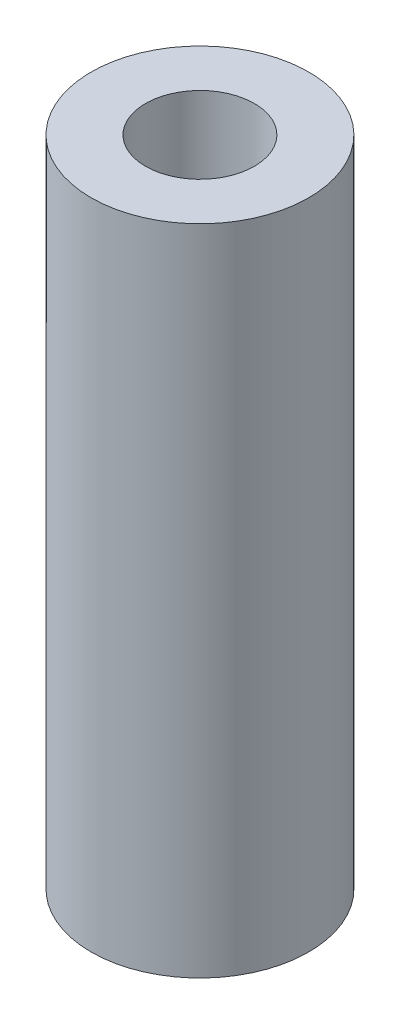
from build123d import *

# Parameters (mm, degrees)
SKETCH1_R   = 6.35
SKETCH1_R_2 = 3.175


with BuildPart() as part:
    # Sweep1: sweep along a path in Sketch2
    with BuildLine(Plane.XY) as sweep1_path:
        Line((0, 0), (0, 38.1))
    # Sketch1 → Sweep1 (sweep)
    with BuildSketch(Plane(origin=(0, 0, 0), x_dir=(1, 0, 0), z_dir=(0, 1, 0))):
        Circle(SKETCH1_R)
        Circle(SKETCH1_R_2, mode=Mode.SUBTRACT)
    sweep(path=sweep1_path.line)


solid = part.part
